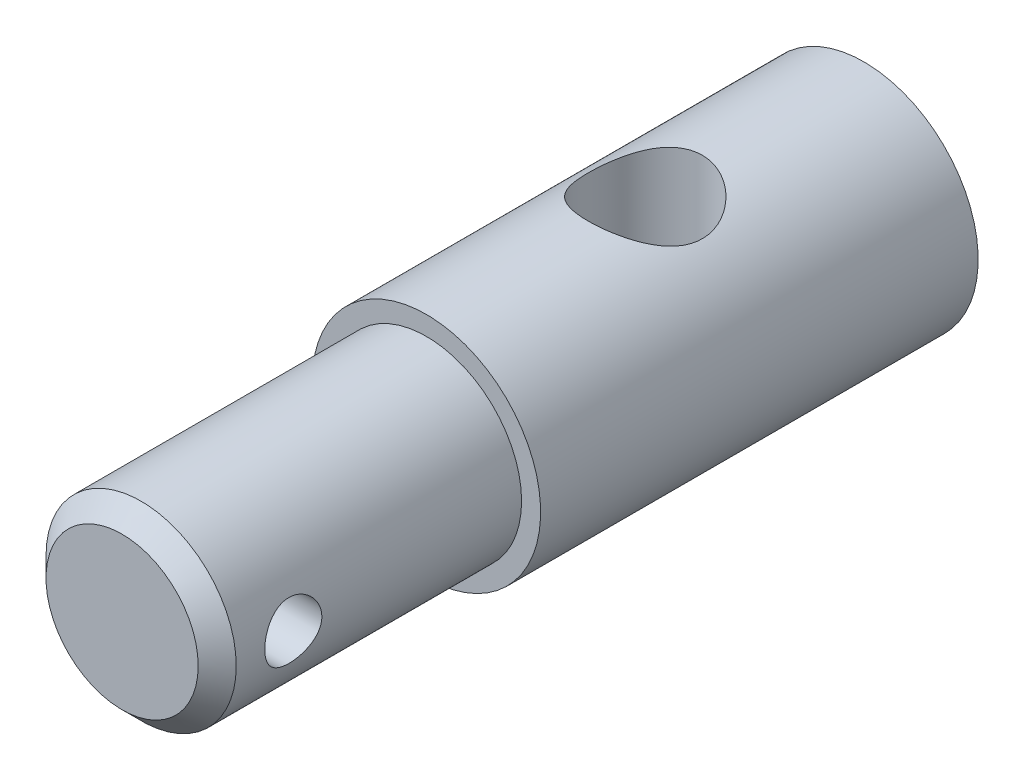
from build123d import *

# Parameters (mm, degrees)
SKETCH_2_R          = 5
EXTRUDE_1_DEPTH     = 16
SKETCH_3_R          = 6
EXTRUDE_2_DEPTH     = 23
SKETCH_4_R          = 3
CUT_EXTRUDE_1_DEPTH = 11.5
SKETCH_5_R          = 1.5
CUT_EXTRUDE_2_DEPTH = 11.5
CHAMFER_1_SIZE      = 1


with BuildPart() as part:
    # Sketch 2 → Extrude 1 (new body)
    with BuildSketch(Plane.XY):
        Circle(SKETCH_2_R)
    extrude(amount=-EXTRUDE_1_DEPTH)

    # Sketch 3 → Extrude 2 (add)
    with BuildSketch(Plane(origin=(0, 0, -16), x_dir=(-1, 0, 0), z_dir=(0, 0, -1))):
        Circle(SKETCH_3_R)
    extrude(amount=EXTRUDE_2_DEPTH)

    # Sketch 4 → Cut-Extrude 1 (cut, symmetric)
    with BuildSketch(Plane(origin=(0, 0, 0), x_dir=(1, 0, 0), z_dir=(0, 1, 0))):
        with Locations(Location((0, 27.5, 0), (0, 0, 270))):
            Circle(SKETCH_4_R)
    extrude(amount=CUT_EXTRUDE_1_DEPTH, both=True, mode=Mode.SUBTRACT)

    # Sketch 5 → Cut-Extrude 2 (cut, symmetric)
    with BuildSketch(Plane(origin=(0, 0, 0), x_dir=(0, 0, -1), z_dir=(1, 0, 0))):
        with Locations((4, 0)):
            Circle(SKETCH_5_R)
    extrude(amount=CUT_EXTRUDE_2_DEPTH, both=True, mode=Mode.SUBTRACT)

    # Chamfer 1
    chamfer_1_edges = [part.edges().sort_by_distance(p)[0] for p in [
        (-5, 0, 0),
    ]]
    chamfer(chamfer_1_edges, length=CHAMFER_1_SIZE)


solid = part.part
